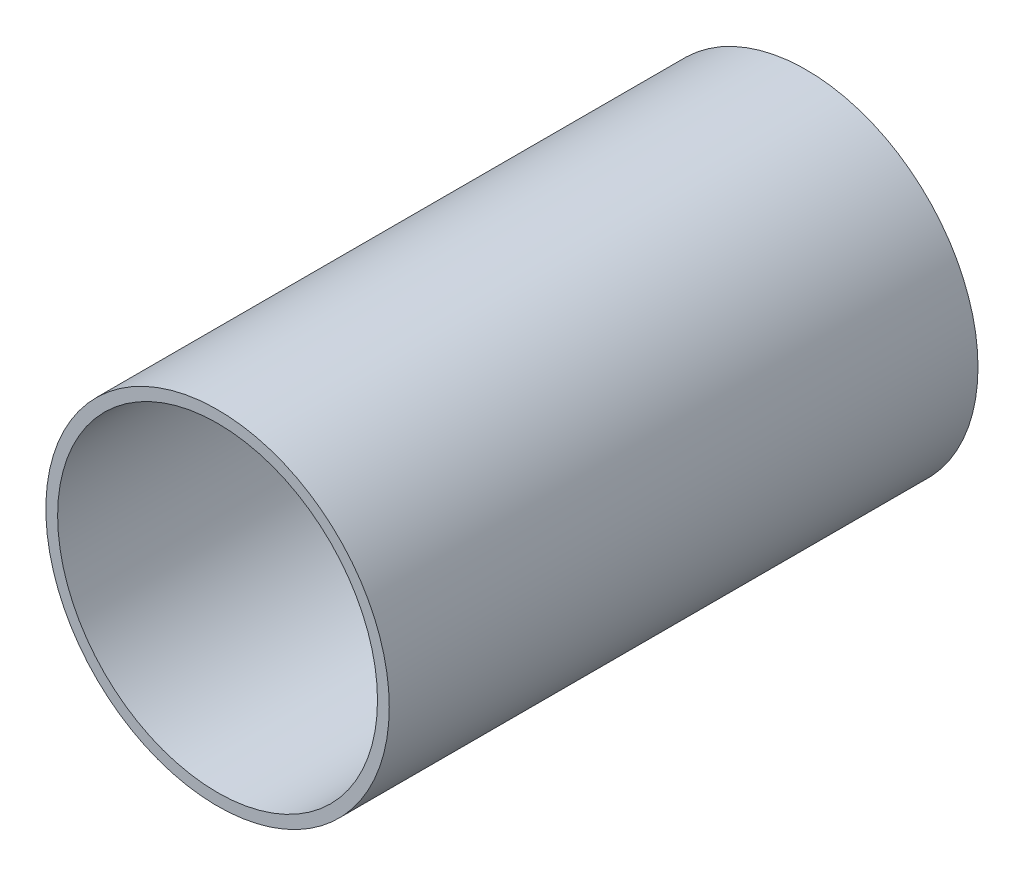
ISO-10303-21;
HEADER;
FILE_DESCRIPTION(('STEP AP214'),'2;1');
FILE_NAME('part.step','',(''),(''),'','','');
FILE_SCHEMA(('AUTOMOTIVE_DESIGN { 1 0 10303 214 1 1 1 1 }'));
ENDSEC;
DATA;
#1=APPLICATION_CONTEXT('core data for automotive mechanical design processes');
#2=APPLICATION_PROTOCOL_DEFINITION('international standard','automotive_design',2000,#1);
#3=PRODUCT_CONTEXT('',#1,'mechanical');
#4=PRODUCT('Part','Part','',(#3));
#5=PRODUCT_RELATED_PRODUCT_CATEGORY('part','',(#4));
#6=PRODUCT_DEFINITION_FORMATION('','',#4);
#7=PRODUCT_DEFINITION_CONTEXT('part definition',#1,'design');
#8=PRODUCT_DEFINITION('design','',#6,#7);
#9=PRODUCT_DEFINITION_SHAPE('','',#8);
#10=(LENGTH_UNIT() NAMED_UNIT(*) SI_UNIT(.MILLI.,.METRE.));
#11=(NAMED_UNIT(*) PLANE_ANGLE_UNIT() SI_UNIT($,.RADIAN.));
#12=(NAMED_UNIT(*) SI_UNIT($,.STERADIAN.) SOLID_ANGLE_UNIT());
#13=UNCERTAINTY_MEASURE_WITH_UNIT(LENGTH_MEASURE(1.E-05),#10,'distance_accuracy_value','');
#14=(GEOMETRIC_REPRESENTATION_CONTEXT(3) GLOBAL_UNCERTAINTY_ASSIGNED_CONTEXT((#13)) GLOBAL_UNIT_ASSIGNED_CONTEXT((#10,
#11,#12)) REPRESENTATION_CONTEXT('',''));
#15=CARTESIAN_POINT('',(0.,0.,0.));
#16=DIRECTION('',(0.,0.,1.));
#17=DIRECTION('',(1.,0.,0.));
#18=AXIS2_PLACEMENT_3D('',#15,#16,#17);
#19=CARTESIAN_POINT('',(0.,0.,-152.4));
#20=DIRECTION('',(0.,0.,1.));
#21=DIRECTION('',(1.,0.,0.));
#22=AXIS2_PLACEMENT_3D('',#19,#20,#21);
#23=CYLINDRICAL_SURFACE('',#22,44.45);
#24=CARTESIAN_POINT('',(0.,0.,-152.4));
#25=DIRECTION('',(0.,0.,1.));
#26=DIRECTION('',(1.,0.,0.));
#27=AXIS2_PLACEMENT_3D('',#24,#25,#26);
#28=CIRCLE('',#27,44.45);
#29=CARTESIAN_POINT('',(44.45,0.,-152.4));
#30=VERTEX_POINT('',#29);
#31=EDGE_CURVE('E10',#30,#30,#28,.T.);
#32=CARTESIAN_POINT('',(0.,0.,0.));
#33=DIRECTION('',(0.,0.,1.));
#34=DIRECTION('',(1.,0.,0.));
#35=AXIS2_PLACEMENT_3D('',#32,#33,#34);
#36=CIRCLE('',#35,44.45);
#37=CARTESIAN_POINT('',(44.45,0.,0.));
#38=VERTEX_POINT('',#37);
#39=EDGE_CURVE('E34',#38,#38,#36,.T.);
#40=CARTESIAN_POINT('',(44.45,0.,-152.4));
#41=CARTESIAN_POINT('',(44.45,0.,-150.8125));
#42=CARTESIAN_POINT('',(44.45,0.,-149.225));
#43=CARTESIAN_POINT('',(44.45,0.,-146.05));
#44=CARTESIAN_POINT('',(44.45,0.,-144.4625));
#45=CARTESIAN_POINT('',(44.45,0.,-141.2875));
#46=CARTESIAN_POINT('',(44.45,0.,-139.7));
#47=CARTESIAN_POINT('',(44.45,0.,-136.525));
#48=CARTESIAN_POINT('',(44.45,0.,-134.9375));
#49=CARTESIAN_POINT('',(44.45,0.,-131.7625));
#50=CARTESIAN_POINT('',(44.45,0.,-130.175));
#51=CARTESIAN_POINT('',(44.45,0.,-127.));
#52=CARTESIAN_POINT('',(44.45,0.,-125.4125));
#53=CARTESIAN_POINT('',(44.45,0.,-122.2375));
#54=CARTESIAN_POINT('',(44.45,0.,-120.65));
#55=CARTESIAN_POINT('',(44.45,0.,-117.475));
#56=CARTESIAN_POINT('',(44.45,0.,-115.8875));
#57=CARTESIAN_POINT('',(44.45,0.,-112.7125));
#58=CARTESIAN_POINT('',(44.45,0.,-111.125));
#59=CARTESIAN_POINT('',(44.45,0.,-107.95));
#60=CARTESIAN_POINT('',(44.45,0.,-106.3625));
#61=CARTESIAN_POINT('',(44.45,0.,-103.1875));
#62=CARTESIAN_POINT('',(44.45,0.,-101.6));
#63=CARTESIAN_POINT('',(44.45,0.,-98.425));
#64=CARTESIAN_POINT('',(44.45,0.,-96.8375));
#65=CARTESIAN_POINT('',(44.45,0.,-93.6625));
#66=CARTESIAN_POINT('',(44.45,0.,-92.075));
#67=CARTESIAN_POINT('',(44.45,0.,-88.9));
#68=CARTESIAN_POINT('',(44.45,0.,-87.3125));
#69=CARTESIAN_POINT('',(44.45,0.,-84.1375));
#70=CARTESIAN_POINT('',(44.45,0.,-82.55));
#71=CARTESIAN_POINT('',(44.45,0.,-79.375));
#72=CARTESIAN_POINT('',(44.45,0.,-77.7875));
#73=CARTESIAN_POINT('',(44.45,0.,-74.6125));
#74=CARTESIAN_POINT('',(44.45,0.,-73.025));
#75=CARTESIAN_POINT('',(44.45,0.,-69.85));
#76=CARTESIAN_POINT('',(44.45,0.,-68.2625));
#77=CARTESIAN_POINT('',(44.45,0.,-65.0875));
#78=CARTESIAN_POINT('',(44.45,0.,-63.5));
#79=CARTESIAN_POINT('',(44.45,0.,-60.325));
#80=CARTESIAN_POINT('',(44.45,0.,-58.7375));
#81=CARTESIAN_POINT('',(44.45,0.,-55.5625));
#82=CARTESIAN_POINT('',(44.45,0.,-53.975));
#83=CARTESIAN_POINT('',(44.45,0.,-50.8));
#84=CARTESIAN_POINT('',(44.45,0.,-49.2125));
#85=CARTESIAN_POINT('',(44.45,0.,-46.0375));
#86=CARTESIAN_POINT('',(44.45,0.,-44.45));
#87=CARTESIAN_POINT('',(44.45,0.,-41.275));
#88=CARTESIAN_POINT('',(44.45,0.,-39.6875));
#89=CARTESIAN_POINT('',(44.45,0.,-36.5125));
#90=CARTESIAN_POINT('',(44.45,0.,-34.925));
#91=CARTESIAN_POINT('',(44.45,0.,-31.75));
#92=CARTESIAN_POINT('',(44.45,0.,-30.1625));
#93=CARTESIAN_POINT('',(44.45,0.,-26.9875));
#94=CARTESIAN_POINT('',(44.45,0.,-25.4));
#95=CARTESIAN_POINT('',(44.45,0.,-22.225));
#96=CARTESIAN_POINT('',(44.45,0.,-20.6375));
#97=CARTESIAN_POINT('',(44.45,0.,-17.4625));
#98=CARTESIAN_POINT('',(44.45,0.,-15.875));
#99=CARTESIAN_POINT('',(44.45,0.,-12.7));
#100=CARTESIAN_POINT('',(44.45,0.,-11.1125));
#101=CARTESIAN_POINT('',(44.45,0.,-7.93750000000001));
#102=CARTESIAN_POINT('',(44.45,0.,-6.35));
#103=CARTESIAN_POINT('',(44.45,0.,-3.175));
#104=CARTESIAN_POINT('',(44.45,0.,-1.5875));
#105=CARTESIAN_POINT('',(44.45,0.,0.));
#106=B_SPLINE_CURVE_WITH_KNOTS('',3,(#40,#41,#42,#43,#44,#45,#46,#47,#48,#49,#50,#51,#52,#53,
#54,#55,#56,#57,#58,#59,#60,#61,#62,#63,#64,#65,#66,#67,#68,#69,#70,#71,#72,#73,#74,#75,#76,#77,
#78,#79,#80,#81,#82,#83,#84,#85,#86,#87,#88,#89,#90,#91,#92,#93,#94,#95,#96,#97,#98,#99,#100,
#101,#102,#103,#104,#105),.UNSPECIFIED.,.F.,.F.,(4,2,2,2,2,2,2,2,2,2,2,2,2,2,2,2,2,2,2,2,2,2,2,
2,2,2,2,2,2,2,2,2,4),(0.,4.7625,9.52500000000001,14.2875,19.05,23.8125,28.575,33.3375,38.1,
42.8625,47.625,52.3875,57.15,61.9125,66.675,71.4375,76.2,80.9625,85.725,90.4875,95.25,100.0125,
104.775,109.5375,114.3,119.0625,123.825,128.5875,133.35,138.1125,142.875,147.6375,152.4),.UNSPECIFIED.);
#107=EDGE_CURVE('BSEAM31',#30,#38,#106,.T.);
#108=ORIENTED_EDGE('',*,*,#31,.T.);
#109=ORIENTED_EDGE('',*,*,#39,.F.);
#110=ORIENTED_EDGE('',*,*,#107,.T.);
#111=ORIENTED_EDGE('',*,*,#107,.F.);
#112=EDGE_LOOP('',(#108,#110,#109,#111));
#113=FACE_BOUND('',#112,.T.);
#114=ADVANCED_FACE('F31',(#113),#23,.T.);
#115=CARTESIAN_POINT('',(0.,0.,-152.4));
#116=DIRECTION('',(0.,0.,1.));
#117=DIRECTION('',(1.,0.,0.));
#118=AXIS2_PLACEMENT_3D('',#115,#116,#117);
#119=PLANE('',#118);
#120=CARTESIAN_POINT('',(0.,0.,-152.4));
#121=DIRECTION('',(0.,0.,1.));
#122=DIRECTION('',(1.,0.,0.));
#123=AXIS2_PLACEMENT_3D('',#120,#121,#122);
#124=CIRCLE('',#123,41.402);
#125=CARTESIAN_POINT('',(41.402,0.,-152.4));
#126=VERTEX_POINT('',#125);
#127=EDGE_CURVE('E41',#126,#126,#124,.T.);
#128=ORIENTED_EDGE('',*,*,#127,.T.);
#129=EDGE_LOOP('',(#128));
#130=FACE_BOUND('',#129,.T.);
#131=ORIENTED_EDGE('',*,*,#31,.F.);
#132=EDGE_LOOP('',(#131));
#133=FACE_BOUND('',#132,.T.);
#134=ADVANCED_FACE('F49',(#130,#133),#119,.F.);
#135=CARTESIAN_POINT('',(0.,0.,0.));
#136=DIRECTION('',(0.,0.,1.));
#137=DIRECTION('',(1.,0.,0.));
#138=AXIS2_PLACEMENT_3D('',#135,#136,#137);
#139=PLANE('',#138);
#140=CARTESIAN_POINT('',(0.,0.,0.));
#141=DIRECTION('',(0.,0.,1.));
#142=DIRECTION('',(1.,0.,0.));
#143=AXIS2_PLACEMENT_3D('',#140,#141,#142);
#144=CIRCLE('',#143,41.402);
#145=CARTESIAN_POINT('',(41.402,0.,0.));
#146=VERTEX_POINT('',#145);
#147=EDGE_CURVE('E43',#146,#146,#144,.T.);
#148=ORIENTED_EDGE('',*,*,#147,.F.);
#149=EDGE_LOOP('',(#148));
#150=FACE_BOUND('',#149,.T.);
#151=ORIENTED_EDGE('',*,*,#39,.T.);
#152=EDGE_LOOP('',(#151));
#153=FACE_BOUND('',#152,.T.);
#154=ADVANCED_FACE('F55',(#150,#153),#139,.T.);
#155=CARTESIAN_POINT('',(0.,0.,-152.4));
#156=DIRECTION('',(0.,0.,1.));
#157=DIRECTION('',(1.,0.,0.));
#158=AXIS2_PLACEMENT_3D('',#155,#156,#157);
#159=CYLINDRICAL_SURFACE('',#158,41.402);
#160=CARTESIAN_POINT('',(41.402,0.,-152.4));
#161=CARTESIAN_POINT('',(41.402,0.,-150.8125));
#162=CARTESIAN_POINT('',(41.402,0.,-149.225));
#163=CARTESIAN_POINT('',(41.402,0.,-146.05));
#164=CARTESIAN_POINT('',(41.402,0.,-144.4625));
#165=CARTESIAN_POINT('',(41.402,0.,-141.2875));
#166=CARTESIAN_POINT('',(41.402,0.,-139.7));
#167=CARTESIAN_POINT('',(41.402,0.,-136.525));
#168=CARTESIAN_POINT('',(41.402,0.,-134.9375));
#169=CARTESIAN_POINT('',(41.402,0.,-131.7625));
#170=CARTESIAN_POINT('',(41.402,0.,-130.175));
#171=CARTESIAN_POINT('',(41.402,0.,-127.));
#172=CARTESIAN_POINT('',(41.402,0.,-125.4125));
#173=CARTESIAN_POINT('',(41.402,0.,-122.2375));
#174=CARTESIAN_POINT('',(41.402,0.,-120.65));
#175=CARTESIAN_POINT('',(41.402,0.,-117.475));
#176=CARTESIAN_POINT('',(41.402,0.,-115.8875));
#177=CARTESIAN_POINT('',(41.402,0.,-112.7125));
#178=CARTESIAN_POINT('',(41.402,0.,-111.125));
#179=CARTESIAN_POINT('',(41.402,0.,-107.95));
#180=CARTESIAN_POINT('',(41.402,0.,-106.3625));
#181=CARTESIAN_POINT('',(41.402,0.,-103.1875));
#182=CARTESIAN_POINT('',(41.402,0.,-101.6));
#183=CARTESIAN_POINT('',(41.402,0.,-98.425));
#184=CARTESIAN_POINT('',(41.402,0.,-96.8375));
#185=CARTESIAN_POINT('',(41.402,0.,-93.6625));
#186=CARTESIAN_POINT('',(41.402,0.,-92.075));
#187=CARTESIAN_POINT('',(41.402,0.,-88.9));
#188=CARTESIAN_POINT('',(41.402,0.,-87.3125));
#189=CARTESIAN_POINT('',(41.402,0.,-84.1375));
#190=CARTESIAN_POINT('',(41.402,0.,-82.55));
#191=CARTESIAN_POINT('',(41.402,0.,-79.375));
#192=CARTESIAN_POINT('',(41.402,0.,-77.7875));
#193=CARTESIAN_POINT('',(41.402,0.,-74.6125));
#194=CARTESIAN_POINT('',(41.402,0.,-73.025));
#195=CARTESIAN_POINT('',(41.402,0.,-69.85));
#196=CARTESIAN_POINT('',(41.402,0.,-68.2625));
#197=CARTESIAN_POINT('',(41.402,0.,-65.0875));
#198=CARTESIAN_POINT('',(41.402,0.,-63.5));
#199=CARTESIAN_POINT('',(41.402,0.,-60.325));
#200=CARTESIAN_POINT('',(41.402,0.,-58.7375));
#201=CARTESIAN_POINT('',(41.402,0.,-55.5625));
#202=CARTESIAN_POINT('',(41.402,0.,-53.975));
#203=CARTESIAN_POINT('',(41.402,0.,-50.8));
#204=CARTESIAN_POINT('',(41.402,0.,-49.2125));
#205=CARTESIAN_POINT('',(41.402,0.,-46.0375));
#206=CARTESIAN_POINT('',(41.402,0.,-44.45));
#207=CARTESIAN_POINT('',(41.402,0.,-41.275));
#208=CARTESIAN_POINT('',(41.402,0.,-39.6875));
#209=CARTESIAN_POINT('',(41.402,0.,-36.5125));
#210=CARTESIAN_POINT('',(41.402,0.,-34.925));
#211=CARTESIAN_POINT('',(41.402,0.,-31.75));
#212=CARTESIAN_POINT('',(41.402,0.,-30.1625));
#213=CARTESIAN_POINT('',(41.402,0.,-26.9875));
#214=CARTESIAN_POINT('',(41.402,0.,-25.4));
#215=CARTESIAN_POINT('',(41.402,0.,-22.225));
#216=CARTESIAN_POINT('',(41.402,0.,-20.6375));
#217=CARTESIAN_POINT('',(41.402,0.,-17.4625));
#218=CARTESIAN_POINT('',(41.402,0.,-15.875));
#219=CARTESIAN_POINT('',(41.402,0.,-12.7));
#220=CARTESIAN_POINT('',(41.402,0.,-11.1125));
#221=CARTESIAN_POINT('',(41.402,0.,-7.93750000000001));
#222=CARTESIAN_POINT('',(41.402,0.,-6.35));
#223=CARTESIAN_POINT('',(41.402,0.,-3.175));
#224=CARTESIAN_POINT('',(41.402,0.,-1.5875));
#225=CARTESIAN_POINT('',(41.402,0.,0.));
#226=B_SPLINE_CURVE_WITH_KNOTS('',3,(#160,#161,#162,#163,#164,#165,#166,#167,#168,#169,#170,
#171,#172,#173,#174,#175,#176,#177,#178,#179,#180,#181,#182,#183,#184,#185,#186,#187,#188,#189,
#190,#191,#192,#193,#194,#195,#196,#197,#198,#199,#200,#201,#202,#203,#204,#205,#206,#207,#208,
#209,#210,#211,#212,#213,#214,#215,#216,#217,#218,#219,#220,#221,#222,#223,#224,#225),
.UNSPECIFIED.,.F.,.F.,(4,2,2,2,2,2,2,2,2,2,2,2,2,2,2,2,2,2,2,2,2,2,2,2,2,2,2,2,2,2,2,2,4),(0.,
4.7625,9.52500000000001,14.2875,19.05,23.8125,28.575,33.3375,38.1,42.8625,47.625,52.3875,57.15,
61.9125,66.675,71.4375,76.2,80.9625,85.725,90.4875,95.25,100.0125,104.775,109.5375,114.3,
119.0625,123.825,128.5875,133.35,138.1125,142.875,147.6375,152.4),.UNSPECIFIED.);
#227=EDGE_CURVE('BSEAM52',#126,#146,#226,.T.);
#228=ORIENTED_EDGE('',*,*,#127,.F.);
#229=ORIENTED_EDGE('',*,*,#147,.T.);
#230=ORIENTED_EDGE('',*,*,#227,.T.);
#231=ORIENTED_EDGE('',*,*,#227,.F.);
#232=EDGE_LOOP('',(#228,#230,#229,#231));
#233=FACE_BOUND('',#232,.T.);
#234=ADVANCED_FACE('F52',(#233),#159,.F.);
#235=CLOSED_SHELL('',(#114,#134,#154,#234));
#236=MANIFOLD_SOLID_BREP('B2',#235);
#237=ADVANCED_BREP_SHAPE_REPRESENTATION('',(#18,#236),#14);
#238=SHAPE_DEFINITION_REPRESENTATION(#9,#237);
ENDSEC;
END-ISO-10303-21;
